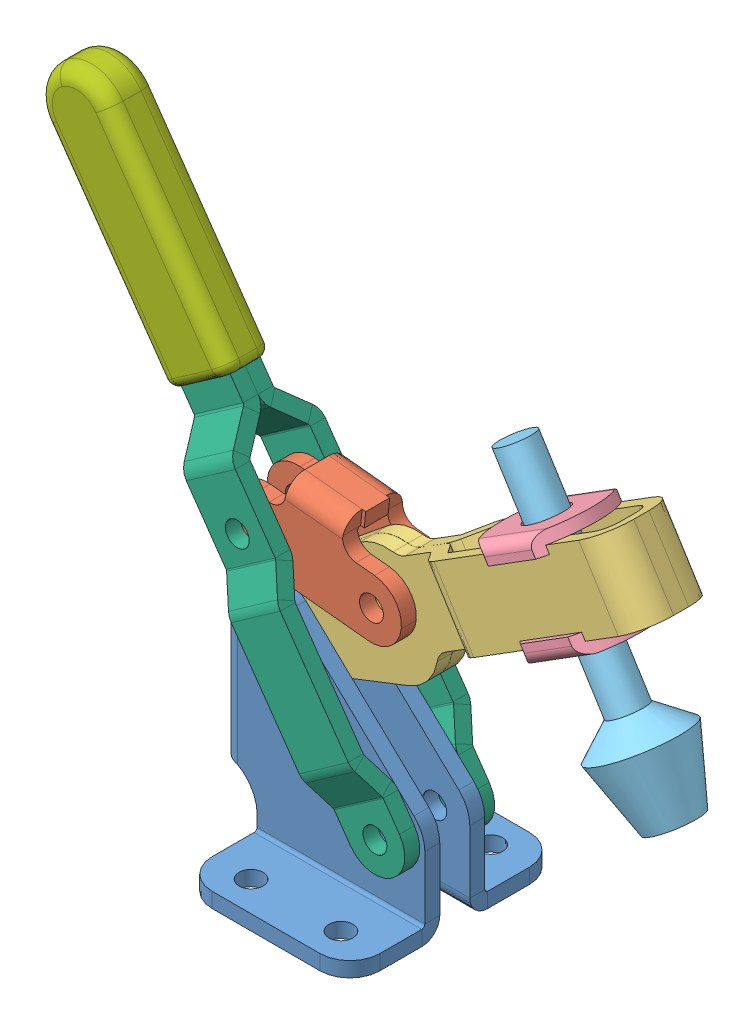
SolidWorks assembly collision.sldasm, configuration Default (file format 3100). Lengths in mm.
Overall size (151.57 125.24 44.45).
11 component instances, 7 part files, 10 mates.
Components (placement in the parent):
- base-2: base.SLDPRT [Default] at origin size (42.93 49.25 44.45)
- link-2: link.SLDPRT [Default] at (6.3491 58.7362 0) x (0.99488 -0.101064 0) z (0 0 1) size (38.1 19.05 12.7)
- hold-down sub-assy-1: hold-down sub-assy.SLDASM [Default] at (9.5597 31.1019 -6.35) x (0.847327 0.531072 0) z (0 0 1) size (96.01 63.5 19.3)
  - arm-1: arm.SLDPRT [Default] at origin size (96.01 23.62 15.88)
  - washer-1: washer.SLDPRT [Default] at (73.787 -2.286 0) x (0 0 -1) z (1 0 0) size (18.8 3.81 22.23)
  - washer-2: washer.SLDPRT [Default] at (73.787 18.161 0) x (0 0 -1) z (-1 0 0) size (18.8 3.81 22.23)
  - hold-down bolt-1: hold-down bolt.sldprt [Default] at (73.787 -32.766 0) size (19.3 63.5 19.3)
- handle sub-assy-1: handle sub-assy.sldasm [Default] at (13.8492 -2.9413 -12.7) x (0.574188 -0.818723 0) z (0 0 1) size (132.59 16.51 25.4)
  - handle-half-1: handle-half.SLDPRT [Default] at (2.3468 22.924 12.7) size (130.68 12.7 12.7)
  - handle-half-2: handle-half.SLDPRT [Default] at (2.3468 35.624 0) x (1 0 0) z (0 0 -1) size (130.68 12.7 12.7)
  - sleeve-1: sleeve.sldprt [Default] at (-128.3362 22.924 3.175) size (52.77 16.51 10.16)
Mates (geometry in assembly coordinates):
- MateCoincident15: coincident aligned: plane of base-2; plane of assembly
- MateCoincident16: coincident anti-aligned: plane of base-2; plane of assembly
- MateCoincident17: coincident anti-aligned: plane of base-2; plane of assembly
- MateConcentric10: concentric aligned: cylinder of base-2; cylinder of handle sub-assy-1/handle-half-1
- MateCoincident20: coincident anti-aligned: plane of base-2; plane of handle sub-assy-1/handle-half-1
- MateConcentric11: concentric aligned: cylinder of handle sub-assy-1/handle-half-1; cylinder of link-2
- MateCoincident21: coincident anti-aligned: plane of handle sub-assy-1/handle-half-1; plane of link-2
- Concentric1: concentric aligned: cylinder of base-2; cylinder of hold-down sub-assy-1/arm-1
- Coincident1: coincident anti-aligned: plane of base-2; plane of hold-down sub-assy-1/arm-1
- Concentric2: concentric aligned: cylinder of hold-down sub-assy-1/arm-1; cylinder of link-2
